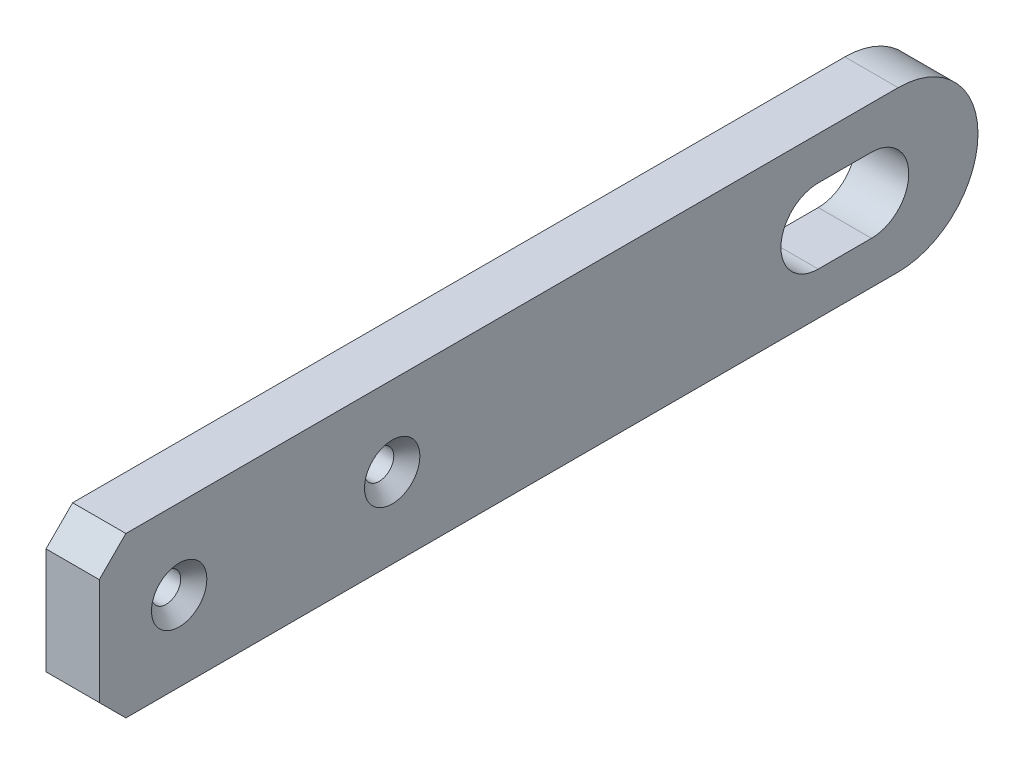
from build123d import *

# Parameters (mm, degrees)
SALIENTE_EXTRUIR1_DEPTH                              = 10
CORTAR_EXTRUIR1_DEPTH                                = 349.527306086
CROQUIS4_W                                           = 2.05
CROQUIS4_H                                           = 44.557394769
AVELLANADO_PARA_TORNILLO_CON_CABEZA_PLAN_D           = 5.5
AVELLANADO_PARA_TORNILLO_CON_CABEZA_PLAN_CSINK_D     = 10.4
AVELLANADO_PARA_TORNILLO_CON_CABEZA_PLAN_CSINK_ANGLE = 90
CHAFL_N1_SIZE                                        = 5


with BuildPart() as part:
    # Croquis1 → Saliente-Extruir1 (new body)
    with BuildSketch(Plane(origin=(6, 0, 0), x_dir=(0, 0, -1), z_dir=(1, 0, 0))):
        with BuildLine():
            Line((332.315712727, 2.740528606), (182.315712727, 2.740528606))
            Line((182.315712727, 2.740528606), (182.315712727, -27.259471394))
            Line((182.315712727, -27.259471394), (332.315712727, -27.259471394))
            ThreePointArc((332.315712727, -27.259471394), (347.315712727, -12.259471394), (332.315712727, 2.740528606))
        make_face()
    extrude(amount=-SALIENTE_EXTRUIR1_DEPTH)

    # Croquis2 → Cortar-Extruir1 (cut, through all)
    with BuildSketch(Plane.ZY.offset(4)):
        with BuildLine():
            Line((-327.315712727, -19.259471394), (-317.315712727, -19.259471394))
            ThreePointArc((-317.315712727, -19.259471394), (-310.315712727, -12.259471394), (-317.315712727, -5.259471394))
            Line((-317.315712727, -5.259471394), (-327.315712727, -5.259471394))
            ThreePointArc((-327.315712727, -5.259471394), (-334.315712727, -12.259471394), (-327.315712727, -19.259471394))
        make_face()
    extrude(amount=-CORTAR_EXTRUIR1_DEPTH, mode=Mode.SUBTRACT)

    # Croquis4 → Di_metro de taladro _4.1 _4.1_1 (revolve, cut)
    with BuildSketch(Plane(origin=(3, -5.5, -302.758317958), x_dir=(0, -1, 0), z_dir=(1, 0, 0))):
        with Locations((1.025, 22.278697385)):
            Rectangle(CROQUIS4_W, CROQUIS4_H)
    revolve(axis=Axis((3, -5.5, -296.408317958), (0, 0, -1)), mode=Mode.SUBTRACT)

    # Avellanado para tornillo con cabeza plan (through all)
    with Locations(Plane(origin=(6, 0, 0), x_dir=(0, 0, -1), z_dir=(1, 0, 0))):
        with Locations((197.315712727, -12.259471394), (237.315712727, -12.259471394)):
            CounterSinkHole(AVELLANADO_PARA_TORNILLO_CON_CABEZA_PLAN_D / 2, AVELLANADO_PARA_TORNILLO_CON_CABEZA_PLAN_CSINK_D / 2, counter_sink_angle=AVELLANADO_PARA_TORNILLO_CON_CABEZA_PLAN_CSINK_ANGLE)

    # Chafl_n1
    chafl_n1_edges = [part.edges().sort_by_distance(p)[0] for p in [
        (1, -27.259471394, -182.315712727),
        (1, 2.740528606, -182.315712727),
    ]]
    chamfer(chafl_n1_edges, length=CHAFL_N1_SIZE)


solid = part.part
